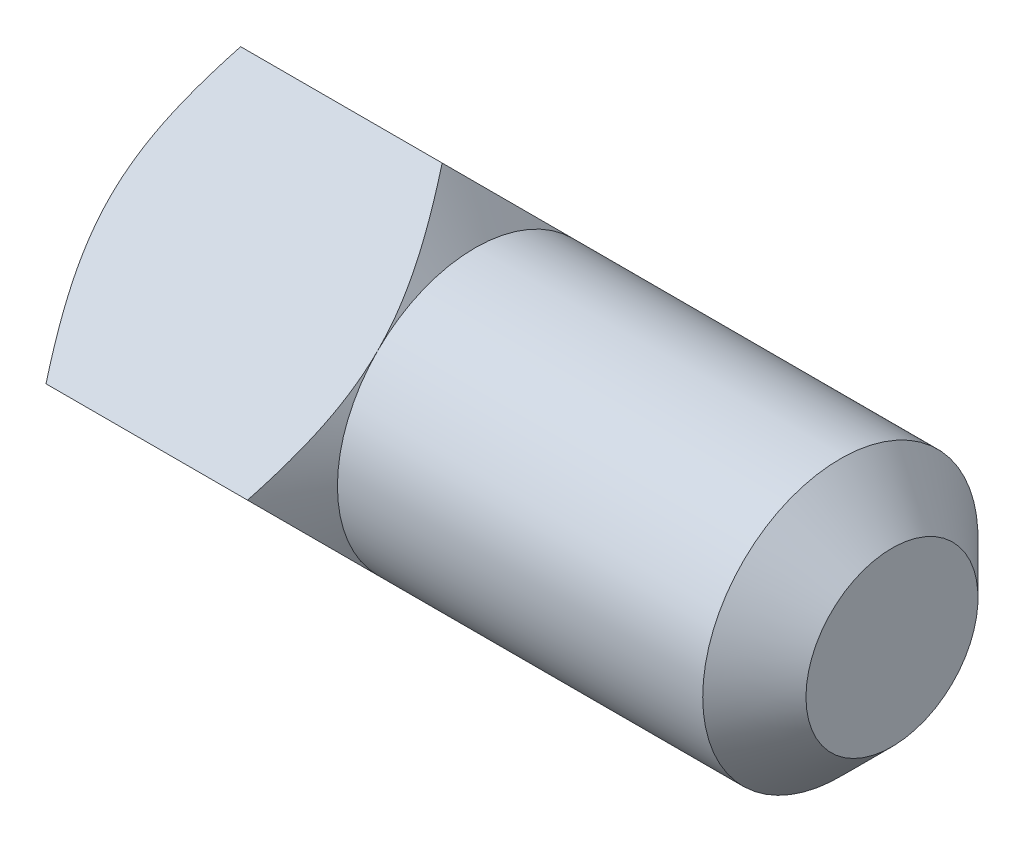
ISO-10303-21;
HEADER;
FILE_DESCRIPTION(('STEP AP214'),'2;1');
FILE_NAME('part.step','',(''),(''),'','','');
FILE_SCHEMA(('AUTOMOTIVE_DESIGN { 1 0 10303 214 1 1 1 1 }'));
ENDSEC;
DATA;
#1=APPLICATION_CONTEXT('core data for automotive mechanical design processes');
#2=APPLICATION_PROTOCOL_DEFINITION('international standard','automotive_design',2000,#1);
#3=PRODUCT_CONTEXT('',#1,'mechanical');
#4=PRODUCT('Part','Part','',(#3));
#5=PRODUCT_RELATED_PRODUCT_CATEGORY('part','',(#4));
#6=PRODUCT_DEFINITION_FORMATION('','',#4);
#7=PRODUCT_DEFINITION_CONTEXT('part definition',#1,'design');
#8=PRODUCT_DEFINITION('design','',#6,#7);
#9=PRODUCT_DEFINITION_SHAPE('','',#8);
#10=(LENGTH_UNIT() NAMED_UNIT(*) SI_UNIT(.MILLI.,.METRE.));
#11=(NAMED_UNIT(*) PLANE_ANGLE_UNIT() SI_UNIT($,.RADIAN.));
#12=(NAMED_UNIT(*) SI_UNIT($,.STERADIAN.) SOLID_ANGLE_UNIT());
#13=UNCERTAINTY_MEASURE_WITH_UNIT(LENGTH_MEASURE(1.E-05),#10,'distance_accuracy_value','');
#14=(GEOMETRIC_REPRESENTATION_CONTEXT(3) GLOBAL_UNCERTAINTY_ASSIGNED_CONTEXT((#13)) GLOBAL_UNIT_ASSIGNED_CONTEXT((#10,
#11,#12)) REPRESENTATION_CONTEXT('',''));
#15=CARTESIAN_POINT('',(0.,0.,0.));
#16=DIRECTION('',(0.,0.,1.));
#17=DIRECTION('',(1.,0.,0.));
#18=AXIS2_PLACEMENT_3D('',#15,#16,#17);
#19=CARTESIAN_POINT('',(0.,0.,0.));
#20=DIRECTION('',(-1.,0.,0.));
#21=DIRECTION('',(0.,0.,1.));
#22=AXIS2_PLACEMENT_3D('',#19,#20,#21);
#23=CYLINDRICAL_SURFACE('',#22,2.);
#24=CARTESIAN_POINT('',(3.94226497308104,0.,0.));
#25=DIRECTION('',(-1.,0.,0.));
#26=DIRECTION('',(0.,0.,1.));
#27=AXIS2_PLACEMENT_3D('',#24,#25,#26);
#28=CIRCLE('',#27,2.);
#29=CARTESIAN_POINT('',(3.9422649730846,1.41421356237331,1.41421356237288));
#30=VERTEX_POINT('',#29);
#31=CARTESIAN_POINT('',(3.94226497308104,1.41421356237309,-1.4142135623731));
#32=VERTEX_POINT('',#31);
#33=EDGE_CURVE('E11',#30,#32,#28,.T.);
#34=ORIENTED_EDGE('',*,*,#33,.F.);
#35=CARTESIAN_POINT('',(3.94226497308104,-1.41421356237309,1.4142135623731));
#36=VERTEX_POINT('',#35);
#37=EDGE_CURVE('E38',#36,#30,#28,.T.);
#38=ORIENTED_EDGE('',*,*,#37,.F.);
#39=CARTESIAN_POINT('',(3.94226497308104,-1.41421356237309,-1.4142135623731));
#40=VERTEX_POINT('',#39);
#41=EDGE_CURVE('E87',#40,#36,#28,.T.);
#42=ORIENTED_EDGE('',*,*,#41,.F.);
#43=EDGE_CURVE('E43',#32,#40,#28,.T.);
#44=ORIENTED_EDGE('',*,*,#43,.F.);
#45=EDGE_LOOP('',(#34,#38,#42,#44));
#46=FACE_BOUND('',#45,.T.);
#47=CARTESIAN_POINT('',(9.25000000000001,0.,0.));
#48=DIRECTION('',(-1.,0.,0.));
#49=DIRECTION('',(0.,0.,1.));
#50=AXIS2_PLACEMENT_3D('',#47,#48,#49);
#51=CIRCLE('',#50,2.);
#52=CARTESIAN_POINT('',(9.25000000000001,0.,2.));
#53=VERTEX_POINT('',#52);
#54=EDGE_CURVE('E222',#53,#53,#51,.T.);
#55=ORIENTED_EDGE('',*,*,#54,.T.);
#56=EDGE_LOOP('',(#55));
#57=FACE_BOUND('',#56,.T.);
#58=ADVANCED_FACE('F33',(#46,#57),#23,.T.);
#59=CARTESIAN_POINT('',(3.46397234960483,0.,0.));
#60=DIRECTION('',(-1.,0.,0.));
#61=DIRECTION('',(0.,0.,1.));
#62=AXIS2_PLACEMENT_3D('',#59,#60,#61);
#63=CONICAL_SURFACE('',#62,2.82842712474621,1.0471975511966);
#64=CARTESIAN_POINT('',(3.4638568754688,2.8286271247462,-0.000200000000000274));
#65=CARTESIAN_POINT('',(3.49161506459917,2.78053478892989,0.0478923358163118));
#66=CARTESIAN_POINT('',(3.51878504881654,2.7322683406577,0.0961587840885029));
#67=CARTESIAN_POINT('',(3.57167045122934,2.63532015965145,0.193106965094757));
#68=CARTESIAN_POINT('',(3.59738536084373,2.58663828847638,0.241788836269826));
#69=CARTESIAN_POINT('',(3.64721601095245,2.48852382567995,0.339903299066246));
#70=CARTESIAN_POINT('',(3.67132090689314,2.43908845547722,0.389338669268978));
#71=CARTESIAN_POINT('',(3.71737604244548,2.33972512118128,0.488702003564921));
#72=CARTESIAN_POINT('',(3.73932646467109,2.28979719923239,0.538629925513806));
#73=CARTESIAN_POINT('',(3.8006124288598,2.14090389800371,0.687523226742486));
#74=CARTESIAN_POINT('',(3.83626445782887,2.04114820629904,0.787278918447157));
#75=CARTESIAN_POINT('',(3.89354790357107,1.83980995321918,0.988617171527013));
#76=CARTESIAN_POINT('',(3.91521440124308,1.73823262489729,1.0901944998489));
#77=CARTESIAN_POINT('',(3.93895616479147,1.55061877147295,1.27780835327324));
#78=CARTESIAN_POINT('',(3.94365263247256,1.46475280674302,1.36367431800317));
#79=CARTESIAN_POINT('',(3.94015885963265,1.29311675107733,1.53531037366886));
#80=CARTESIAN_POINT('',(3.93196285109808,1.20734672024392,1.62108040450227));
#81=CARTESIAN_POINT('',(3.90378450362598,1.03666151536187,1.79176560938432));
#82=CARTESIAN_POINT('',(3.88378039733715,0.951748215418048,1.87667890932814));
#83=CARTESIAN_POINT('',(3.83421705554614,0.783348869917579,2.04507825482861));
#84=CARTESIAN_POINT('',(3.80465560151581,0.699863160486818,2.12856396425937));
#85=CARTESIAN_POINT('',(3.75037319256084,0.564467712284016,2.26395941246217));
#86=CARTESIAN_POINT('',(3.72780043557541,0.512114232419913,2.31631289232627));
#87=CARTESIAN_POINT('',(3.68024330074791,0.407975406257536,2.42045171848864));
#88=CARTESIAN_POINT('',(3.65525964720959,0.356189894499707,2.47223723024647));
#89=CARTESIAN_POINT('',(3.60344889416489,0.253386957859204,2.57504016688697));
#90=CARTESIAN_POINT('',(3.57663195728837,0.202366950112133,2.62606017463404));
#91=CARTESIAN_POINT('',(3.52137669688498,0.100767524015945,2.72765960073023));
#92=CARTESIAN_POINT('',(3.49293839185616,0.0501881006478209,2.77823902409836));
#93=CARTESIAN_POINT('',(3.46385687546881,-0.00020000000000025,2.82862712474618));
#94=B_SPLINE_CURVE_WITH_KNOTS('',3,(#64,#65,#66,#67,#68,#69,#70,#71,#72,#73,#74,#75,#76,#77,#78,
#79,#80,#81,#82,#83,#84,#85,#86,#87,#88,#89,#90,#91,#92,#93),.UNSPECIFIED.,.F.,.F.,(4,2,2,2,2,2,
2,2,2,2,2,2,2,2,4),(0.,0.220383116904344,0.440842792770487,0.662662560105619,0.884463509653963,
1.32047426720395,1.75538705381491,2.11928790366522,2.48335160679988,2.84808853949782,
3.21291019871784,3.4450819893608,3.67718424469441,3.90809048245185,4.13899408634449),.UNSPECIFIED.);
#95=CARTESIAN_POINT('',(3.46397234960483,2.82842712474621,0.));
#96=VERTEX_POINT('',#95);
#97=EDGE_CURVE('E110',#96,#30,#94,.T.);
#98=ORIENTED_EDGE('',*,*,#97,.T.);
#99=ORIENTED_EDGE('',*,*,#33,.T.);
#100=CARTESIAN_POINT('',(3.46385687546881,-0.000200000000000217,-2.82862712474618));
#101=CARTESIAN_POINT('',(3.49161506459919,0.0478923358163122,-2.78053478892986));
#102=CARTESIAN_POINT('',(3.51878504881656,0.0961587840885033,-2.73226834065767));
#103=CARTESIAN_POINT('',(3.57167045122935,0.193106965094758,-2.63532015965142));
#104=CARTESIAN_POINT('',(3.59738536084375,0.241788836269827,-2.58663828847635));
#105=CARTESIAN_POINT('',(3.64721601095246,0.339903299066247,-2.48852382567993));
#106=CARTESIAN_POINT('',(3.67132090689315,0.389338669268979,-2.4390884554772));
#107=CARTESIAN_POINT('',(3.71737604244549,0.488702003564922,-2.33972512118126));
#108=CARTESIAN_POINT('',(3.7393264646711,0.538629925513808,-2.28979719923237));
#109=CARTESIAN_POINT('',(3.80061242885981,0.687523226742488,-2.1409038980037));
#110=CARTESIAN_POINT('',(3.83626445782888,0.78727891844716,-2.04114820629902));
#111=CARTESIAN_POINT('',(3.89354790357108,0.988617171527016,-1.83980995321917));
#112=CARTESIAN_POINT('',(3.91521440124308,1.0901944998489,-1.73823262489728));
#113=CARTESIAN_POINT('',(3.93895616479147,1.27780835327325,-1.55061877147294));
#114=CARTESIAN_POINT('',(3.94365263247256,1.36367431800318,-1.46475280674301));
#115=CARTESIAN_POINT('',(3.94015885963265,1.53531037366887,-1.29311675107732));
#116=CARTESIAN_POINT('',(3.93196285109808,1.62108040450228,-1.20734672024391));
#117=CARTESIAN_POINT('',(3.90378450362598,1.79176560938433,-1.03666151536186));
#118=CARTESIAN_POINT('',(3.88378039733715,1.87667890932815,-0.951748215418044));
#119=CARTESIAN_POINT('',(3.83421705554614,2.04507825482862,-0.783348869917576));
#120=CARTESIAN_POINT('',(3.8046556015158,2.12856396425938,-0.699863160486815));
#121=CARTESIAN_POINT('',(3.75037319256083,2.26395941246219,-0.564467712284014));
#122=CARTESIAN_POINT('',(3.7278004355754,2.31631289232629,-0.512114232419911));
#123=CARTESIAN_POINT('',(3.6802433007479,2.42045171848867,-0.407975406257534));
#124=CARTESIAN_POINT('',(3.65525964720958,2.47223723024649,-0.356189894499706));
#125=CARTESIAN_POINT('',(3.60344889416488,2.575040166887,-0.253386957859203));
#126=CARTESIAN_POINT('',(3.57663195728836,2.62606017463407,-0.202366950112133));
#127=CARTESIAN_POINT('',(3.52137669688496,2.72765960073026,-0.100767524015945));
#128=CARTESIAN_POINT('',(3.49293839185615,2.77823902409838,-0.0501881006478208));
#129=CARTESIAN_POINT('',(3.4638568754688,2.8286271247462,0.00020000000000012));
#130=B_SPLINE_CURVE_WITH_KNOTS('',3,(#100,#101,#102,#103,#104,#105,#106,#107,#108,#109,#110,
#111,#112,#113,#114,#115,#116,#117,#118,#119,#120,#121,#122,#123,#124,#125,#126,#127,#128,#129),
.UNSPECIFIED.,.F.,.F.,(4,2,2,2,2,2,2,2,2,2,2,2,2,2,4),(0.,0.220383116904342,0.440842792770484,
0.662662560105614,0.884463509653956,1.32047426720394,1.7553870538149,2.11928790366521,
2.48335160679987,2.84808853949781,3.21291019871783,3.4450819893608,3.67718424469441,
3.90809048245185,4.13899408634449),.UNSPECIFIED.);
#131=EDGE_CURVE('E148',#32,#96,#130,.T.);
#132=ORIENTED_EDGE('',*,*,#131,.T.);
#133=EDGE_LOOP('',(#98,#99,#132));
#134=FACE_BOUND('',#133,.T.);
#135=ADVANCED_FACE('F127',(#134),#63,.T.);
#136=CARTESIAN_POINT('',(3.46397234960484,0.,-2.82842712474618));
#137=VERTEX_POINT('',#136);
#138=EDGE_CURVE('E141',#137,#32,#130,.T.);
#139=ORIENTED_EDGE('',*,*,#138,.T.);
#140=ORIENTED_EDGE('',*,*,#43,.T.);
#141=CARTESIAN_POINT('',(3.4638568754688,-2.8286271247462,0.000199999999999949));
#142=CARTESIAN_POINT('',(3.49161506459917,-2.78053478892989,-0.0478923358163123));
#143=CARTESIAN_POINT('',(3.51878504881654,-2.7322683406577,-0.0961587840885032));
#144=CARTESIAN_POINT('',(3.57167045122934,-2.63532015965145,-0.193106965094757));
#145=CARTESIAN_POINT('',(3.59738536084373,-2.58663828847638,-0.241788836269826));
#146=CARTESIAN_POINT('',(3.64721601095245,-2.48852382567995,-0.339903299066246));
#147=CARTESIAN_POINT('',(3.67132090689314,-2.43908845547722,-0.389338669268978));
#148=CARTESIAN_POINT('',(3.71737604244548,-2.33972512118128,-0.488702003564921));
#149=CARTESIAN_POINT('',(3.73932646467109,-2.28979719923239,-0.538629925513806));
#150=CARTESIAN_POINT('',(3.8006124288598,-2.14090389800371,-0.687523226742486));
#151=CARTESIAN_POINT('',(3.83626445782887,-2.04114820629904,-0.787278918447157));
#152=CARTESIAN_POINT('',(3.89354790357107,-1.83980995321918,-0.988617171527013));
#153=CARTESIAN_POINT('',(3.91521440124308,-1.73823262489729,-1.0901944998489));
#154=CARTESIAN_POINT('',(3.93895616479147,-1.55061877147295,-1.27780835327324));
#155=CARTESIAN_POINT('',(3.94365263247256,-1.46475280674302,-1.36367431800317));
#156=CARTESIAN_POINT('',(3.94015885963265,-1.29311675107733,-1.53531037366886));
#157=CARTESIAN_POINT('',(3.93196285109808,-1.20734672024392,-1.62108040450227));
#158=CARTESIAN_POINT('',(3.90378450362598,-1.03666151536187,-1.79176560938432));
#159=CARTESIAN_POINT('',(3.88378039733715,-0.951748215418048,-1.87667890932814));
#160=CARTESIAN_POINT('',(3.83421705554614,-0.783348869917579,-2.04507825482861));
#161=CARTESIAN_POINT('',(3.80465560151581,-0.699863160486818,-2.12856396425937));
#162=CARTESIAN_POINT('',(3.75037319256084,-0.564467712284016,-2.26395941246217));
#163=CARTESIAN_POINT('',(3.72780043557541,-0.512114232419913,-2.31631289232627));
#164=CARTESIAN_POINT('',(3.68024330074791,-0.407975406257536,-2.42045171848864));
#165=CARTESIAN_POINT('',(3.65525964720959,-0.356189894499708,-2.47223723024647));
#166=CARTESIAN_POINT('',(3.60344889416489,-0.253386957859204,-2.57504016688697));
#167=CARTESIAN_POINT('',(3.57663195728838,-0.202366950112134,-2.62606017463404));
#168=CARTESIAN_POINT('',(3.52137669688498,-0.100767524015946,-2.72765960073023));
#169=CARTESIAN_POINT('',(3.49293839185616,-0.0501881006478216,-2.77823902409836));
#170=CARTESIAN_POINT('',(3.46385687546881,0.000199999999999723,-2.82862712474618));
#171=B_SPLINE_CURVE_WITH_KNOTS('',3,(#141,#142,#143,#144,#145,#146,#147,#148,#149,#150,#151,
#152,#153,#154,#155,#156,#157,#158,#159,#160,#161,#162,#163,#164,#165,#166,#167,#168,#169,#170),
.UNSPECIFIED.,.F.,.F.,(4,2,2,2,2,2,2,2,2,2,2,2,2,2,4),(0.,0.220383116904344,0.440842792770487,
0.662662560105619,0.884463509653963,1.32047426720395,1.75538705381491,2.11928790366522,
2.48335160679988,2.84808853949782,3.21291019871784,3.4450819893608,3.67718424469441,
3.90809048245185,4.13899408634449),.UNSPECIFIED.);
#172=EDGE_CURVE('E56',#40,#137,#171,.T.);
#173=ORIENTED_EDGE('',*,*,#172,.T.);
#174=EDGE_LOOP('',(#139,#140,#173));
#175=FACE_BOUND('',#174,.T.);
#176=ADVANCED_FACE('F132',(#175),#63,.T.);
#177=CARTESIAN_POINT('',(3.46397234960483,-2.82842712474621,0.));
#178=VERTEX_POINT('',#177);
#179=EDGE_CURVE('E98',#178,#40,#171,.T.);
#180=ORIENTED_EDGE('',*,*,#179,.T.);
#181=ORIENTED_EDGE('',*,*,#41,.T.);
#182=CARTESIAN_POINT('',(3.46385687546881,0.000199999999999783,2.82862712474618));
#183=CARTESIAN_POINT('',(3.49161506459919,-0.0478923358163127,2.78053478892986));
#184=CARTESIAN_POINT('',(3.51878504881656,-0.0961587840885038,2.73226834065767));
#185=CARTESIAN_POINT('',(3.57167045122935,-0.193106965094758,2.63532015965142));
#186=CARTESIAN_POINT('',(3.59738536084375,-0.241788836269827,2.58663828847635));
#187=CARTESIAN_POINT('',(3.64721601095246,-0.339903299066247,2.48852382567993));
#188=CARTESIAN_POINT('',(3.67132090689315,-0.38933866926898,2.4390884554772));
#189=CARTESIAN_POINT('',(3.71737604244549,-0.488702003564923,2.33972512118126));
#190=CARTESIAN_POINT('',(3.7393264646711,-0.538629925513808,2.28979719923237));
#191=CARTESIAN_POINT('',(3.80061242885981,-0.687523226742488,2.1409038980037));
#192=CARTESIAN_POINT('',(3.83626445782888,-0.787278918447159,2.04114820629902));
#193=CARTESIAN_POINT('',(3.89354790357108,-0.988617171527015,1.83980995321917));
#194=CARTESIAN_POINT('',(3.91521440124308,-1.0901944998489,1.73823262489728));
#195=CARTESIAN_POINT('',(3.93895616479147,-1.27780835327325,1.55061877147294));
#196=CARTESIAN_POINT('',(3.94365263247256,-1.36367431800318,1.46475280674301));
#197=CARTESIAN_POINT('',(3.94015885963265,-1.53531037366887,1.29311675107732));
#198=CARTESIAN_POINT('',(3.93196285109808,-1.62108040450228,1.20734672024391));
#199=CARTESIAN_POINT('',(3.90378450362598,-1.79176560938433,1.03666151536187));
#200=CARTESIAN_POINT('',(3.88378039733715,-1.87667890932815,0.951748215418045));
#201=CARTESIAN_POINT('',(3.83421705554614,-2.04507825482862,0.783348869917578));
#202=CARTESIAN_POINT('',(3.8046556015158,-2.12856396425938,0.699863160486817));
#203=CARTESIAN_POINT('',(3.75037319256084,-2.26395941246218,0.564467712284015));
#204=CARTESIAN_POINT('',(3.7278004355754,-2.31631289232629,0.512114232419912));
#205=CARTESIAN_POINT('',(3.6802433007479,-2.42045171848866,0.407975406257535));
#206=CARTESIAN_POINT('',(3.65525964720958,-2.47223723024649,0.356189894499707));
#207=CARTESIAN_POINT('',(3.60344889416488,-2.575040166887,0.253386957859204));
#208=CARTESIAN_POINT('',(3.57663195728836,-2.62606017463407,0.202366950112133));
#209=CARTESIAN_POINT('',(3.52137669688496,-2.72765960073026,0.100767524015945));
#210=CARTESIAN_POINT('',(3.49293839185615,-2.77823902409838,0.0501881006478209));
#211=CARTESIAN_POINT('',(3.4638568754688,-2.8286271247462,-0.000200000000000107));
#212=B_SPLINE_CURVE_WITH_KNOTS('',3,(#182,#183,#184,#185,#186,#187,#188,#189,#190,#191,#192,
#193,#194,#195,#196,#197,#198,#199,#200,#201,#202,#203,#204,#205,#206,#207,#208,#209,#210,#211),
.UNSPECIFIED.,.F.,.F.,(4,2,2,2,2,2,2,2,2,2,2,2,2,2,4),(0.,0.220383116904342,0.440842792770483,
0.662662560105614,0.884463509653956,1.32047426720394,1.75538705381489,2.1192879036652,
2.48335160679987,2.8480885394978,3.21291019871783,3.4450819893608,3.67718424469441,
3.90809048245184,4.13899408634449),.UNSPECIFIED.);
#213=EDGE_CURVE('E96',#36,#178,#212,.T.);
#214=ORIENTED_EDGE('',*,*,#213,.T.);
#215=EDGE_LOOP('',(#180,#181,#214));
#216=FACE_BOUND('',#215,.T.);
#217=ADVANCED_FACE('F95',(#216),#63,.T.);
#218=CARTESIAN_POINT('',(3.46397234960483,0.,2.82842712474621));
#219=VERTEX_POINT('',#218);
#220=EDGE_CURVE('E103',#219,#36,#212,.T.);
#221=ORIENTED_EDGE('',*,*,#220,.T.);
#222=ORIENTED_EDGE('',*,*,#37,.T.);
#223=EDGE_CURVE('E109',#30,#219,#94,.T.);
#224=ORIENTED_EDGE('',*,*,#223,.T.);
#225=EDGE_LOOP('',(#221,#222,#224));
#226=FACE_BOUND('',#225,.T.);
#227=ADVANCED_FACE('F108',(#226),#63,.T.);
#228=CARTESIAN_POINT('',(4.,2.8284271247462,0.));
#229=DIRECTION('',(0.,-0.707106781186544,-0.707106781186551));
#230=DIRECTION('',(0.,0.707106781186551,-0.707106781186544));
#231=AXIS2_PLACEMENT_3D('',#228,#229,#230);
#232=PLANE('',#231);
#233=ORIENTED_EDGE('',*,*,#223,.F.);
#234=ORIENTED_EDGE('',*,*,#97,.F.);
#235=DIRECTION('',(-1.,0.,0.));
#236=VECTOR('',#235,1.);
#237=CARTESIAN_POINT('',(4.,2.8284271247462,0.));
#238=LINE('',#237,#236);
#239=CARTESIAN_POINT('',(0.536027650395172,2.8284271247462,0.));
#240=VERTEX_POINT('',#239);
#241=EDGE_CURVE('E185',#96,#240,#238,.T.);
#242=ORIENTED_EDGE('',*,*,#241,.T.);
#243=CARTESIAN_POINT('',(0.536143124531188,-0.000200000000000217,2.82862712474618));
#244=CARTESIAN_POINT('',(0.508384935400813,0.0478923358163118,2.78053478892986));
#245=CARTESIAN_POINT('',(0.481214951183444,0.096158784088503,2.73226834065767));
#246=CARTESIAN_POINT('',(0.428329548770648,0.193106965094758,2.63532015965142));
#247=CARTESIAN_POINT('',(0.402614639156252,0.241788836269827,2.58663828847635));
#248=CARTESIAN_POINT('',(0.352783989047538,0.339903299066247,2.48852382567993));
#249=CARTESIAN_POINT('',(0.328679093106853,0.389338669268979,2.4390884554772));
#250=CARTESIAN_POINT('',(0.282623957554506,0.488702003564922,2.33972512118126));
#251=CARTESIAN_POINT('',(0.2606735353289,0.538629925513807,2.28979719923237));
#252=CARTESIAN_POINT('',(0.199387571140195,0.687523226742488,2.1409038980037));
#253=CARTESIAN_POINT('',(0.163735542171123,0.787278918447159,2.04114820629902));
#254=CARTESIAN_POINT('',(0.106452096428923,0.988617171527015,1.83980995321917));
#255=CARTESIAN_POINT('',(0.084785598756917,1.0901944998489,1.73823262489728));
#256=CARTESIAN_POINT('',(0.0610438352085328,1.27780835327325,1.55061877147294));
#257=CARTESIAN_POINT('',(0.0563473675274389,1.36367431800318,1.46475280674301));
#258=CARTESIAN_POINT('',(0.0598411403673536,1.53531037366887,1.29311675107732));
#259=CARTESIAN_POINT('',(0.0680371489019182,1.62108040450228,1.20734672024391));
#260=CARTESIAN_POINT('',(0.0962154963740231,1.79176560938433,1.03666151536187));
#261=CARTESIAN_POINT('',(0.116219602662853,1.87667890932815,0.951748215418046));
#262=CARTESIAN_POINT('',(0.165782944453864,2.04507825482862,0.783348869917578));
#263=CARTESIAN_POINT('',(0.195344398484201,2.12856396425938,0.699863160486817));
#264=CARTESIAN_POINT('',(0.249626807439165,2.26395941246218,0.564467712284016));
#265=CARTESIAN_POINT('',(0.272199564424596,2.31631289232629,0.512114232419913));
#266=CARTESIAN_POINT('',(0.319756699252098,2.42045171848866,0.407975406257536));
#267=CARTESIAN_POINT('',(0.344740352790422,2.47223723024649,0.356189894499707));
#268=CARTESIAN_POINT('',(0.396551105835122,2.575040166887,0.253386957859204));
#269=CARTESIAN_POINT('',(0.423368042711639,2.62606017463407,0.202366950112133));
#270=CARTESIAN_POINT('',(0.478623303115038,2.72765960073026,0.100767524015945));
#271=CARTESIAN_POINT('',(0.507061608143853,2.77823902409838,0.0501881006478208));
#272=CARTESIAN_POINT('',(0.536143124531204,2.8286271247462,-0.000200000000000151));
#273=B_SPLINE_CURVE_WITH_KNOTS('',3,(#243,#244,#245,#246,#247,#248,#249,#250,#251,#252,#253,
#254,#255,#256,#257,#258,#259,#260,#261,#262,#263,#264,#265,#266,#267,#268,#269,#270,#271,#272),
.UNSPECIFIED.,.F.,.F.,(4,2,2,2,2,2,2,2,2,2,2,2,2,2,4),(0.,0.220383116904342,0.440842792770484,
0.662662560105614,0.884463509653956,1.32047426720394,1.75538705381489,2.11928790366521,
2.48335160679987,2.8480885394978,3.21291019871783,3.4450819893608,3.67718424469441,
3.90809048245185,4.13899408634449),.UNSPECIFIED.);
#274=CARTESIAN_POINT('',(0.536027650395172,0.,2.8284271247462));
#275=VERTEX_POINT('',#274);
#276=EDGE_CURVE('E179',#275,#240,#273,.T.);
#277=ORIENTED_EDGE('',*,*,#276,.F.);
#278=DIRECTION('',(-1.,0.,0.));
#279=VECTOR('',#278,1.);
#280=CARTESIAN_POINT('',(4.,0.,2.82842712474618));
#281=LINE('',#280,#279);
#282=EDGE_CURVE('E91',#219,#275,#281,.T.);
#283=ORIENTED_EDGE('',*,*,#282,.F.);
#284=EDGE_LOOP('',(#233,#234,#242,#277,#283));
#285=FACE_BOUND('',#284,.T.);
#286=ADVANCED_FACE('F35',(#285),#232,.F.);
#287=CARTESIAN_POINT('',(4.,-2.8284271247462,0.));
#288=DIRECTION('',(0.,0.707106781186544,-0.707106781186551));
#289=DIRECTION('',(0.,0.707106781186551,0.707106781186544));
#290=AXIS2_PLACEMENT_3D('',#287,#288,#289);
#291=PLANE('',#290);
#292=ORIENTED_EDGE('',*,*,#213,.F.);
#293=ORIENTED_EDGE('',*,*,#220,.F.);
#294=ORIENTED_EDGE('',*,*,#282,.T.);
#295=CARTESIAN_POINT('',(0.536143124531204,-2.8286271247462,-0.000200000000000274));
#296=CARTESIAN_POINT('',(0.508384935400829,-2.78053478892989,0.0478923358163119));
#297=CARTESIAN_POINT('',(0.481214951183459,-2.7322683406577,0.0961587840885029));
#298=CARTESIAN_POINT('',(0.428329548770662,-2.63532015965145,0.193106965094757));
#299=CARTESIAN_POINT('',(0.402614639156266,-2.58663828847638,0.241788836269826));
#300=CARTESIAN_POINT('',(0.352783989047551,-2.48852382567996,0.339903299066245));
#301=CARTESIAN_POINT('',(0.328679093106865,-2.43908845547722,0.389338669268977));
#302=CARTESIAN_POINT('',(0.282623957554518,-2.33972512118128,0.48870200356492));
#303=CARTESIAN_POINT('',(0.260673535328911,-2.28979719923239,0.538629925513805));
#304=CARTESIAN_POINT('',(0.199387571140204,-2.14090389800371,0.687523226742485));
#305=CARTESIAN_POINT('',(0.16373554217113,-2.04114820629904,0.787278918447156));
#306=CARTESIAN_POINT('',(0.106452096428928,-1.83980995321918,0.988617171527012));
#307=CARTESIAN_POINT('',(0.0847855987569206,-1.73823262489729,1.0901944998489));
#308=CARTESIAN_POINT('',(0.0610438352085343,-1.55061877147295,1.27780835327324));
#309=CARTESIAN_POINT('',(0.0563473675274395,-1.46475280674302,1.36367431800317));
#310=CARTESIAN_POINT('',(0.0598411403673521,-1.29311675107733,1.53531037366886));
#311=CARTESIAN_POINT('',(0.0680371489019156,-1.20734672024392,1.62108040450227));
#312=CARTESIAN_POINT('',(0.0962154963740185,-1.03666151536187,1.79176560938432));
#313=CARTESIAN_POINT('',(0.116219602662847,-0.951748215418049,1.87667890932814));
#314=CARTESIAN_POINT('',(0.165782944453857,-0.78334886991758,2.0450782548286));
#315=CARTESIAN_POINT('',(0.195344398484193,-0.699863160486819,2.12856396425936));
#316=CARTESIAN_POINT('',(0.249626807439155,-0.564467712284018,2.26395941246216));
#317=CARTESIAN_POINT('',(0.272199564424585,-0.512114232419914,2.31631289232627));
#318=CARTESIAN_POINT('',(0.319756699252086,-0.407975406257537,2.42045171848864));
#319=CARTESIAN_POINT('',(0.34474035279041,-0.356189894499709,2.47223723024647));
#320=CARTESIAN_POINT('',(0.396551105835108,-0.253386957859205,2.57504016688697));
#321=CARTESIAN_POINT('',(0.423368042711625,-0.202366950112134,2.62606017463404));
#322=CARTESIAN_POINT('',(0.478623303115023,-0.100767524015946,2.72765960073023));
#323=CARTESIAN_POINT('',(0.507061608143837,-0.0501881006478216,2.77823902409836));
#324=CARTESIAN_POINT('',(0.536143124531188,0.000200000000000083,2.82862712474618));
#325=B_SPLINE_CURVE_WITH_KNOTS('',3,(#295,#296,#297,#298,#299,#300,#301,#302,#303,#304,#305,
#306,#307,#308,#309,#310,#311,#312,#313,#314,#315,#316,#317,#318,#319,#320,#321,#322,#323,#324),
.UNSPECIFIED.,.F.,.F.,(4,2,2,2,2,2,2,2,2,2,2,2,2,2,4),(0.,0.220383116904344,0.440842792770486,
0.662662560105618,0.884463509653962,1.32047426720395,1.75538705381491,2.11928790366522,
2.48335160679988,2.84808853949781,3.21291019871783,3.4450819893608,3.67718424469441,
3.90809048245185,4.13899408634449),.UNSPECIFIED.);
#326=CARTESIAN_POINT('',(0.536027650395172,-2.8284271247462,0.));
#327=VERTEX_POINT('',#326);
#328=EDGE_CURVE('E173',#327,#275,#325,.T.);
#329=ORIENTED_EDGE('',*,*,#328,.F.);
#330=DIRECTION('',(-1.,0.,0.));
#331=VECTOR('',#330,1.);
#332=CARTESIAN_POINT('',(4.,-2.8284271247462,0.));
#333=LINE('',#332,#331);
#334=EDGE_CURVE('E106',#178,#327,#333,.T.);
#335=ORIENTED_EDGE('',*,*,#334,.F.);
#336=EDGE_LOOP('',(#292,#293,#294,#329,#335));
#337=FACE_BOUND('',#336,.T.);
#338=ADVANCED_FACE('F102',(#337),#291,.F.);
#339=CARTESIAN_POINT('',(4.,-2.8284271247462,0.));
#340=DIRECTION('',(0.,0.707106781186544,0.707106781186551));
#341=DIRECTION('',(0.,-0.707106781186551,0.707106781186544));
#342=AXIS2_PLACEMENT_3D('',#339,#340,#341);
#343=PLANE('',#342);
#344=ORIENTED_EDGE('',*,*,#172,.F.);
#345=ORIENTED_EDGE('',*,*,#179,.F.);
#346=ORIENTED_EDGE('',*,*,#334,.T.);
#347=CARTESIAN_POINT('',(0.536143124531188,0.000199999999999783,-2.82862712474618));
#348=CARTESIAN_POINT('',(0.508384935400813,-0.0478923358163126,-2.78053478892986));
#349=CARTESIAN_POINT('',(0.481214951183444,-0.0961587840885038,-2.73226834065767));
#350=CARTESIAN_POINT('',(0.428329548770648,-0.193106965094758,-2.63532015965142));
#351=CARTESIAN_POINT('',(0.402614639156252,-0.241788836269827,-2.58663828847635));
#352=CARTESIAN_POINT('',(0.352783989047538,-0.339903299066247,-2.48852382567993));
#353=CARTESIAN_POINT('',(0.328679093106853,-0.389338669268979,-2.4390884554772));
#354=CARTESIAN_POINT('',(0.282623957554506,-0.488702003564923,-2.33972512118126));
#355=CARTESIAN_POINT('',(0.2606735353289,-0.538629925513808,-2.28979719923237));
#356=CARTESIAN_POINT('',(0.199387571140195,-0.687523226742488,-2.1409038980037));
#357=CARTESIAN_POINT('',(0.163735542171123,-0.78727891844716,-2.04114820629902));
#358=CARTESIAN_POINT('',(0.106452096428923,-0.988617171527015,-1.83980995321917));
#359=CARTESIAN_POINT('',(0.0847855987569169,-1.0901944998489,-1.73823262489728));
#360=CARTESIAN_POINT('',(0.0610438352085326,-1.27780835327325,-1.55061877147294));
#361=CARTESIAN_POINT('',(0.0563473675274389,-1.36367431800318,-1.46475280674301));
#362=CARTESIAN_POINT('',(0.0598411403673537,-1.53531037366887,-1.29311675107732));
#363=CARTESIAN_POINT('',(0.0680371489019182,-1.62108040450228,-1.20734672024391));
#364=CARTESIAN_POINT('',(0.0962154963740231,-1.79176560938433,-1.03666151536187));
#365=CARTESIAN_POINT('',(0.116219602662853,-1.87667890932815,-0.951748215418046));
#366=CARTESIAN_POINT('',(0.165782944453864,-2.04507825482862,-0.783348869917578));
#367=CARTESIAN_POINT('',(0.195344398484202,-2.12856396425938,-0.699863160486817));
#368=CARTESIAN_POINT('',(0.249626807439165,-2.26395941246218,-0.564467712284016));
#369=CARTESIAN_POINT('',(0.272199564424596,-2.31631289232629,-0.512114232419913));
#370=CARTESIAN_POINT('',(0.319756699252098,-2.42045171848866,-0.407975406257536));
#371=CARTESIAN_POINT('',(0.344740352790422,-2.47223723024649,-0.356189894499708));
#372=CARTESIAN_POINT('',(0.396551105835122,-2.575040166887,-0.253386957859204));
#373=CARTESIAN_POINT('',(0.423368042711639,-2.62606017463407,-0.202366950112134));
#374=CARTESIAN_POINT('',(0.478623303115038,-2.72765960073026,-0.100767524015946));
#375=CARTESIAN_POINT('',(0.507061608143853,-2.77823902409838,-0.0501881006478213));
#376=CARTESIAN_POINT('',(0.536143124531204,-2.8286271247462,0.000199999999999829));
#377=B_SPLINE_CURVE_WITH_KNOTS('',3,(#347,#348,#349,#350,#351,#352,#353,#354,#355,#356,#357,
#358,#359,#360,#361,#362,#363,#364,#365,#366,#367,#368,#369,#370,#371,#372,#373,#374,#375,#376),
.UNSPECIFIED.,.F.,.F.,(4,2,2,2,2,2,2,2,2,2,2,2,2,2,4),(0.,0.220383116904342,0.440842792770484,
0.662662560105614,0.884463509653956,1.32047426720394,1.75538705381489,2.1192879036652,
2.48335160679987,2.8480885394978,3.21291019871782,3.4450819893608,3.67718424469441,
3.90809048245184,4.13899408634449),.UNSPECIFIED.);
#378=CARTESIAN_POINT('',(0.536027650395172,0.,-2.8284271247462));
#379=VERTEX_POINT('',#378);
#380=EDGE_CURVE('E166',#379,#327,#377,.T.);
#381=ORIENTED_EDGE('',*,*,#380,.F.);
#382=DIRECTION('',(-1.,0.,0.));
#383=VECTOR('',#382,1.);
#384=CARTESIAN_POINT('',(4.,0.,-2.82842712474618));
#385=LINE('',#384,#383);
#386=EDGE_CURVE('E187',#137,#379,#385,.T.);
#387=ORIENTED_EDGE('',*,*,#386,.F.);
#388=EDGE_LOOP('',(#344,#345,#346,#381,#387));
#389=FACE_BOUND('',#388,.T.);
#390=ADVANCED_FACE('F154',(#389),#343,.F.);
#391=CARTESIAN_POINT('',(4.,2.8284271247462,0.));
#392=DIRECTION('',(0.,-0.707106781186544,0.707106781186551));
#393=DIRECTION('',(0.,-0.707106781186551,-0.707106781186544));
#394=AXIS2_PLACEMENT_3D('',#391,#392,#393);
#395=PLANE('',#394);
#396=ORIENTED_EDGE('',*,*,#131,.F.);
#397=ORIENTED_EDGE('',*,*,#138,.F.);
#398=ORIENTED_EDGE('',*,*,#386,.T.);
#399=CARTESIAN_POINT('',(0.536143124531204,2.8286271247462,0.000199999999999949));
#400=CARTESIAN_POINT('',(0.508384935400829,2.78053478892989,-0.0478923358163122));
#401=CARTESIAN_POINT('',(0.481214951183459,2.7322683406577,-0.0961587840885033));
#402=CARTESIAN_POINT('',(0.428329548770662,2.63532015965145,-0.193106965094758));
#403=CARTESIAN_POINT('',(0.402614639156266,2.58663828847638,-0.241788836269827));
#404=CARTESIAN_POINT('',(0.35278398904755,2.48852382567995,-0.339903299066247));
#405=CARTESIAN_POINT('',(0.328679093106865,2.43908845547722,-0.389338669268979));
#406=CARTESIAN_POINT('',(0.282623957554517,2.33972512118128,-0.488702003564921));
#407=CARTESIAN_POINT('',(0.260673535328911,2.28979719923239,-0.538629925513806));
#408=CARTESIAN_POINT('',(0.199387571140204,2.14090389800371,-0.687523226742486));
#409=CARTESIAN_POINT('',(0.16373554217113,2.04114820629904,-0.787278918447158));
#410=CARTESIAN_POINT('',(0.106452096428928,1.83980995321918,-0.988617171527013));
#411=CARTESIAN_POINT('',(0.0847855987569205,1.73823262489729,-1.0901944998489));
#412=CARTESIAN_POINT('',(0.0610438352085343,1.55061877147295,-1.27780835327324));
#413=CARTESIAN_POINT('',(0.0563473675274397,1.46475280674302,-1.36367431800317));
#414=CARTESIAN_POINT('',(0.0598411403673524,1.29311675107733,-1.53531037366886));
#415=CARTESIAN_POINT('',(0.0680371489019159,1.20734672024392,-1.62108040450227));
#416=CARTESIAN_POINT('',(0.0962154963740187,1.03666151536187,-1.79176560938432));
#417=CARTESIAN_POINT('',(0.116219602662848,0.951748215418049,-1.87667890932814));
#418=CARTESIAN_POINT('',(0.165782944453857,0.78334886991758,-2.0450782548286));
#419=CARTESIAN_POINT('',(0.195344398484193,0.699863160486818,-2.12856396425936));
#420=CARTESIAN_POINT('',(0.249626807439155,0.564467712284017,-2.26395941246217));
#421=CARTESIAN_POINT('',(0.272199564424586,0.512114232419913,-2.31631289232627));
#422=CARTESIAN_POINT('',(0.319756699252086,0.407975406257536,-2.42045171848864));
#423=CARTESIAN_POINT('',(0.34474035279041,0.356189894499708,-2.47223723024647));
#424=CARTESIAN_POINT('',(0.396551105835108,0.253386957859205,-2.57504016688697));
#425=CARTESIAN_POINT('',(0.423368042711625,0.202366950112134,-2.62606017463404));
#426=CARTESIAN_POINT('',(0.478623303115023,0.100767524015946,-2.72765960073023));
#427=CARTESIAN_POINT('',(0.507061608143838,0.050188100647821,-2.77823902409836));
#428=CARTESIAN_POINT('',(0.536143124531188,-0.000200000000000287,-2.82862712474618));
#429=B_SPLINE_CURVE_WITH_KNOTS('',3,(#399,#400,#401,#402,#403,#404,#405,#406,#407,#408,#409,
#410,#411,#412,#413,#414,#415,#416,#417,#418,#419,#420,#421,#422,#423,#424,#425,#426,#427,#428),
.UNSPECIFIED.,.F.,.F.,(4,2,2,2,2,2,2,2,2,2,2,2,2,2,4),(0.,0.220383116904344,0.440842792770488,
0.66266256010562,0.884463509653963,1.32047426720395,1.75538705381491,2.11928790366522,
2.48335160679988,2.84808853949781,3.21291019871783,3.4450819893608,3.67718424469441,
3.90809048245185,4.13899408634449),.UNSPECIFIED.);
#430=EDGE_CURVE('E160',#240,#379,#429,.T.);
#431=ORIENTED_EDGE('',*,*,#430,.F.);
#432=ORIENTED_EDGE('',*,*,#241,.F.);
#433=EDGE_LOOP('',(#396,#397,#398,#431,#432));
#434=FACE_BOUND('',#433,.T.);
#435=ADVANCED_FACE('F151',(#434),#395,.F.);
#436=CARTESIAN_POINT('',(0.,0.,0.));
#437=DIRECTION('',(1.,0.,0.));
#438=DIRECTION('',(0.,0.,-1.));
#439=AXIS2_PLACEMENT_3D('',#436,#437,#438);
#440=CONICAL_SURFACE('',#439,1.9,1.0471975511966);
#441=CARTESIAN_POINT('',(0.,0.,0.));
#442=DIRECTION('',(-1.,0.,0.));
#443=DIRECTION('',(0.,0.,1.));
#444=AXIS2_PLACEMENT_3D('',#441,#442,#443);
#445=CIRCLE('',#444,1.9);
#446=CARTESIAN_POINT('',(0.,0.,1.9));
#447=VERTEX_POINT('',#446);
#448=EDGE_CURVE('E167',#447,#447,#445,.T.);
#449=ORIENTED_EDGE('',*,*,#448,.F.);
#450=EDGE_LOOP('',(#449));
#451=FACE_BOUND('',#450,.T.);
#452=ORIENTED_EDGE('',*,*,#276,.T.);
#453=ORIENTED_EDGE('',*,*,#430,.T.);
#454=ORIENTED_EDGE('',*,*,#380,.T.);
#455=ORIENTED_EDGE('',*,*,#328,.T.);
#456=EDGE_LOOP('',(#452,#453,#454,#455));
#457=FACE_BOUND('',#456,.T.);
#458=ADVANCED_FACE('F136',(#451,#457),#440,.T.);
#459=CARTESIAN_POINT('',(0.,0.,2.82842712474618));
#460=DIRECTION('',(-1.,0.,0.));
#461=DIRECTION('',(0.,0.,1.));
#462=AXIS2_PLACEMENT_3D('',#459,#460,#461);
#463=PLANE('',#462);
#464=ORIENTED_EDGE('',*,*,#448,.T.);
#465=EDGE_LOOP('',(#464));
#466=FACE_BOUND('',#465,.T.);
#467=ADVANCED_FACE('F156',(#466),#463,.T.);
#468=CARTESIAN_POINT('',(9.25000000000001,0.,0.));
#469=DIRECTION('',(-1.,0.,0.));
#470=DIRECTION('',(0.,0.,1.));
#471=AXIS2_PLACEMENT_3D('',#468,#469,#470);
#472=CONICAL_SURFACE('',#471,2.,0.785398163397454);
#473=CARTESIAN_POINT('',(10.,0.,0.));
#474=DIRECTION('',(-1.,0.,0.));
#475=DIRECTION('',(0.,0.,1.));
#476=AXIS2_PLACEMENT_3D('',#473,#474,#475);
#477=CIRCLE('',#476,1.25);
#478=CARTESIAN_POINT('',(10.,0.,1.25));
#479=VERTEX_POINT('',#478);
#480=EDGE_CURVE('E149',#479,#479,#477,.T.);
#481=ORIENTED_EDGE('',*,*,#480,.T.);
#482=EDGE_LOOP('',(#481));
#483=FACE_BOUND('',#482,.T.);
#484=ORIENTED_EDGE('',*,*,#54,.F.);
#485=EDGE_LOOP('',(#484));
#486=FACE_BOUND('',#485,.T.);
#487=ADVANCED_FACE('F208',(#483,#486),#472,.T.);
#488=CARTESIAN_POINT('',(10.,2.,0.));
#489=DIRECTION('',(-1.,0.,0.));
#490=DIRECTION('',(0.,0.,1.));
#491=AXIS2_PLACEMENT_3D('',#488,#489,#490);
#492=PLANE('',#491);
#493=ORIENTED_EDGE('',*,*,#480,.F.);
#494=EDGE_LOOP('',(#493));
#495=FACE_BOUND('',#494,.T.);
#496=ADVANCED_FACE('F134',(#495),#492,.F.);
#497=CLOSED_SHELL('',(#58,#135,#176,#217,#227,#286,#338,#390,#435,#458,#467,#487,#496));
#498=MANIFOLD_SOLID_BREP('B2',#497);
#499=ADVANCED_BREP_SHAPE_REPRESENTATION('',(#18,#498),#14);
#500=SHAPE_DEFINITION_REPRESENTATION(#9,#499);
ENDSEC;
END-ISO-10303-21;
